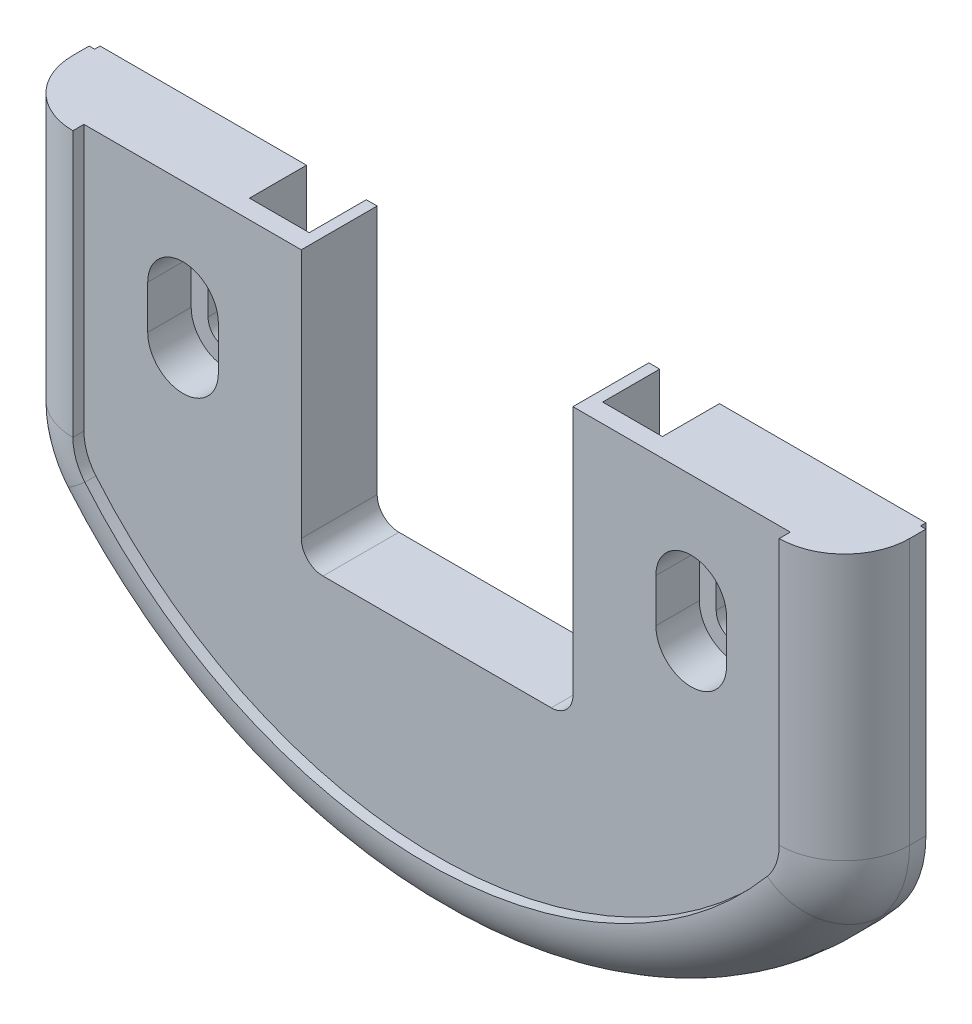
from build123d import *

# Parameters (mm, degrees)
BOSS_EXTRUDE1_DEPTH            = 8
FILLET1_R                      = 6
CUT_EXTRUDE1_DEPTH             = 0.5
CUT_EXTRUDE2_DEPTH             = 1.016
CBORE_FOR_M3_SHCS1_D           = 3.4
CBORE_FOR_M3_SHCS1_CBORE_D     = 6.5
CBORE_FOR_M3_SHCS1_CBORE_DEPTH = 4
SKETCH6_W                      = 5.5
SKETCH6_H                      = 20
CUT_EXTRUDE3_DEPTH             = 5.25
FILLET2_R                      = 2
CUT_EXTRUDE4_DEPTH             = 4
CUT_EXTRUDE5_DEPTH             = 62.817514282


with BuildPart() as part:
    # Sketch1 → Boss-Extrude1 (new body)
    with BuildSketch(Plane.XY):
        with BuildLine():
            Line((12.5, 0), (38.5, 0))
            Line((38.5, 0), (38.5, -24.4463))
            ThreePointArc((38.5, -24.4463), (37.854189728, -28.107212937), (35.994721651, -31.326177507))
            ThreePointArc((35.994721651, -31.326177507), (0, -48.104), (-35.994721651, -31.326177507))
            ThreePointArc((-35.994721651, -31.326177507), (-37.854189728, -28.107212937), (-38.5, -24.4463))
            Line((-38.5, -24.4463), (-38.5, 0))
            Line((-38.5, 0), (-12.5, 0))
            Line((-12.5, 0), (-12.5, -25))
            Line((-12.5, -25), (12.5, -25))
            Line((12.5, -25), (12.5, 0))
        make_face()
    extrude(amount=BOSS_EXTRUDE1_DEPTH)

    # Fillet1
    fillet1_edges = [part.edges().sort_by_distance(p)[0] for p in [
        (-38.5, -12.22315, 8),
        (-37.854189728, -28.107212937, 8),
        (0, -48.104, 8),
        (37.854189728, -28.107212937, 8),
        (38.5, -12.22315, 8),
    ]]
    fillet(fillet1_edges, radius=FILLET1_R)

    # Sketch2 → Cut-Extrude1 (cut)
    with BuildSketch(Plane(origin=(0, 0, 0), x_dir=(-1, 0, 0), z_dir=(0, 0, -1))):
        with BuildLine():
            Line((-38, -24.4463), (-38, 0))
            Line((-38, 0), (-38.5, 0))
            Line((-38.5, 0), (-38.5, -24.4463))
            ThreePointArc((-38.5, -24.4463), (-37.854189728, -28.107212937), (-35.994721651, -31.326177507))
            ThreePointArc((-35.994721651, -31.326177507), (0, -48.104), (35.994721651, -31.326177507))
            ThreePointArc((35.994721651, -31.326177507), (37.854189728, -28.107212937), (38.5, -24.4463))
            Line((38.5, -24.4463), (38.5, 0))
            Line((38.5, 0), (38, 0))
            Line((38, 0), (38, -24.4463))
            ThreePointArc((38, -24.4463), (37.38436993, -27.936130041), (35.61179908, -31.004664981))
            ThreePointArc((35.61179908, -31.004664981), (0, -47.604), (-35.61179908, -31.004664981))
            ThreePointArc((-35.61179908, -31.004664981), (-37.38436993, -27.936130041), (-38, -24.4463))
        make_face()
    extrude(amount=-CUT_EXTRUDE1_DEPTH, mode=Mode.SUBTRACT)

    # Sketch3 → Cut-Extrude2 (cut)
    with BuildSketch(Plane.XY.offset(8)):
        with BuildLine():
            Line((-12.5, 0), (-32.5, 0))
            Line((-32.5, 0), (-32.5, -24.4463))
            ThreePointArc((-32.5, -24.4463), (-32.216352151, -26.054218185), (-31.399650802, -27.468027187))
            ThreePointArc((-31.399650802, -27.468027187), (0, -42.104), (31.399650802, -27.468027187))
            ThreePointArc((31.399650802, -27.468027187), (32.216352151, -26.054218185), (32.5, -24.4463))
            Line((32.5, -24.4463), (32.5, 0))
            Line((32.5, 0), (12.5, 0))
            Line((12.5, 0), (12.5, -25))
            Line((12.5, -25), (-12.5, -25))
            Line((-12.5, -25), (-12.5, 0))
        make_face()
    extrude(amount=-CUT_EXTRUDE2_DEPTH, mode=Mode.SUBTRACT)

    # CBORE for M3 SHCS1 (through all)
    with Locations(Plane.XY.offset(6.984)):
        with Locations((-23.381119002, -11.643)):
            cbore_for_m3_shcs1 = CounterBoreHole(CBORE_FOR_M3_SHCS1_D / 2, CBORE_FOR_M3_SHCS1_CBORE_D / 2, CBORE_FOR_M3_SHCS1_CBORE_DEPTH)

    # Mirror1: CBORE for M3 SHCS1 across plane
    add(cbore_for_m3_shcs1.mirror(Plane(origin=(0, 0, 0), x_dir=(0, 0, 1), z_dir=(1, 0, 0))), mode=Mode.SUBTRACT)

    # Sketch6 → Cut-Extrude3 (cut)
    with BuildSketch(Plane(origin=(0, 0, 0), x_dir=(-1, 0, 0), z_dir=(0, 0, -1))):
        with Locations((16.25, -10)):
            Rectangle(SKETCH6_W, SKETCH6_H)
        with Locations((-16.25, -10)):
            Rectangle(SKETCH6_W, SKETCH6_H)
    extrude(amount=-CUT_EXTRUDE3_DEPTH, mode=Mode.SUBTRACT)

    # Fillet2
    fillet2_edges = [part.edges().sort_by_distance(p)[0] for p in [
        (-13.5, -20, 2.625),
        (-19, -20, 2.625),
        (13.5, -20, 2.625),
        (19, -20, 2.625),
        (-12.5, -25, 3.492),
        (12.5, -25, 3.492),
    ]]
    fillet(fillet2_edges, radius=FILLET2_R)

    # Sketch8 → Cut-Extrude4 (cut)
    with BuildSketch(Plane.XY.offset(6.984)):
        with BuildLine():
            Line((-26.631119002, -13.643), (-26.631119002, -9.643))
            ThreePointArc((-26.631119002, -9.643), (-23.381119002, -6.393), (-20.131119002, -9.643))
            Line((-20.131119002, -9.643), (-20.131119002, -13.643))
            ThreePointArc((-20.131119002, -13.643), (-23.381119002, -16.893), (-26.631119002, -13.643))
        make_face()
        with BuildLine():
            Line((26.631119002, -13.643), (26.631119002, -9.643))
            ThreePointArc((26.631119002, -9.643), (23.381119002, -6.393), (20.131119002, -9.643))
            Line((20.131119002, -9.643), (20.131119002, -13.643))
            ThreePointArc((20.131119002, -13.643), (23.381119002, -16.893), (26.631119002, -13.643))
        make_face()
    extrude(amount=-CUT_EXTRUDE4_DEPTH, mode=Mode.SUBTRACT)

    # Sketch9 → Cut-Extrude5 (cut, through all)
    with BuildSketch(Plane.XY.offset(2.984)):
        with BuildLine():
            Line((-25.081119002, -13.643), (-25.081119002, -9.643))
            ThreePointArc((-25.081119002, -9.643), (-23.381119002, -7.943), (-21.681119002, -9.643))
            Line((-21.681119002, -9.643), (-21.681119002, -13.643))
            ThreePointArc((-21.681119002, -13.643), (-23.381119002, -15.343), (-25.081119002, -13.643))
        make_face()
        with BuildLine():
            Line((25.081119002, -13.643), (25.081119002, -9.643))
            ThreePointArc((25.081119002, -9.643), (23.381119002, -7.943), (21.681119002, -9.643))
            Line((21.681119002, -9.643), (21.681119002, -13.643))
            ThreePointArc((21.681119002, -13.643), (23.381119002, -15.343), (25.081119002, -13.643))
        make_face()
    extrude(amount=-CUT_EXTRUDE5_DEPTH, mode=Mode.SUBTRACT)


solid = part.part
